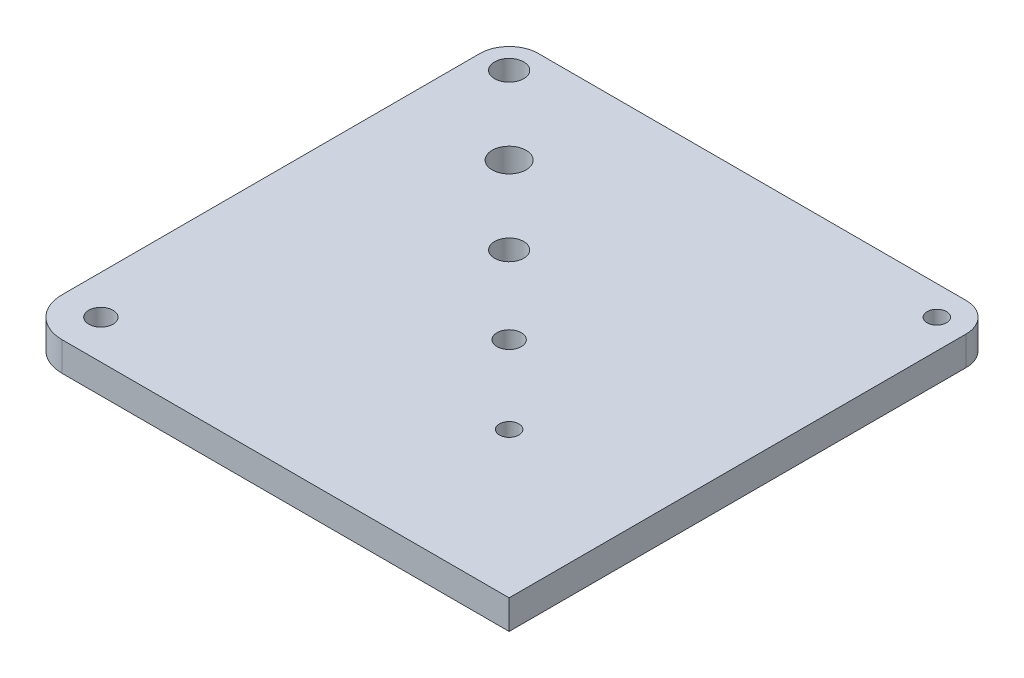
from build123d import *

# Parameters (mm, degrees)
SKETCH1_R           = 1.5
SKETCH1_R_2         = 1
SKETCH1_R_3         = 1.25
SKETCH1_R_4         = 1.75
BOSS_EXTRUDE1_DEPTH = 3


with BuildPart() as part:
    # Sketch1 → Boss-Extrude1 (new body)
    with BuildSketch(Plane(origin=(0, 0, 0), x_dir=(1, 0, 0), z_dir=(0, 1, 0))):
        with BuildLine():
            Line((-21, -25), (25, -25))
            Line((25, -25), (25, 22))
            ThreePointArc((25, 22), (24.121320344, 24.121320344), (22, 25))
            Line((22, 25), (-22, 25))
            ThreePointArc((-22, 25), (-24.121320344, 24.121320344), (-25, 22))
            Line((-25, 22), (-25, -21))
            ThreePointArc((-25, -21), (-23.828427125, -23.828427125), (-21, -25))
        make_face()
        with Locations(Location((-22, 22, 0), (0, 0, 270))):
            Circle(SKETCH1_R, mode=Mode.SUBTRACT)
        with Locations(Location((22, 22, 0), (0, 0, 270))):
            Circle(SKETCH1_R_2, mode=Mode.SUBTRACT)
        with Locations(Location((-21, -21, 0), (0, 0, 270))):
            Circle(SKETCH1_R_3, mode=Mode.SUBTRACT)
        with Locations(Location((-14, 14, 0), (0, 0, 270))):
            Circle(SKETCH1_R_4, mode=Mode.SUBTRACT)
        with Locations(Location((-6, 6, 0), (0, 0, 270))):
            Circle(SKETCH1_R, mode=Mode.SUBTRACT)
        with Locations(Location((2, -2, 0), (0, 0, 270))):
            Circle(SKETCH1_R_3, mode=Mode.SUBTRACT)
        with Locations(Location((10, -10, 0), (0, 0, 270))):
            Circle(SKETCH1_R_2, mode=Mode.SUBTRACT)
    extrude(amount=BOSS_EXTRUDE1_DEPTH)


solid = part.part
